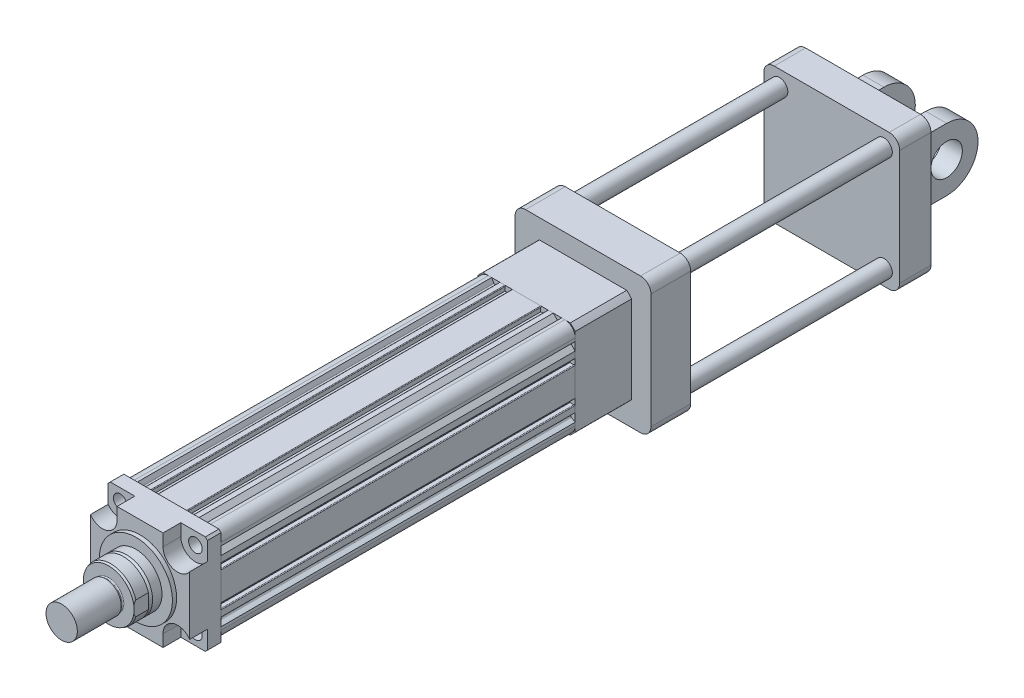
from build123d import *
from OCP.BRepFilletAPI import BRepFilletAPI_MakeChamfer

# Parameters (mm, degrees)
SKETCH_1_R          = 40
SKETCH_1_R_2        = 4.35
EXTRUDE_1_DEPTH     = 340
EXTRUDE_1_2_DEPTH   = 30
SKETCH_3_R          = 35
EXTRUDE_2_DEPTH     = 4
SKETCH_3_3_R        = 6.5
CUT_EXTRUDE_1_DEPTH = 30
SKETCH_3_4_R        = 6.5
CUT_EXTRUDE_2_DEPTH = 17
SKETCH_4_R          = 25
EXTRUDE_3_DEPTH     = 12
CHAMFER_1_SIZE      = 3
CHAMFER_1_SIZE2     = 1.732050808
EXTRUDE_4_DEPTH     = 14
CHAMFER_2_SIZE      = 2
CHAMFER_2_SIZE2     = 0.727940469
SKETCH_6_R          = 13.5
EXTRUDE_5_DEPTH     = 3
SKETCH_7_R          = 15
EXTRUDE_6_DEPTH     = 42
FILLET_1_R          = 1
EXTRUDE_7_DEPTH     = 54
SKETCH_9_W          = 130
SKETCH_9_H          = 130
EXTRUDE_8_DEPTH     = 38
SKETCH_10_R         = 40
CUT_EXTRUDE_3_DEPTH = 18.5
SKETCH_11_R         = 32
CUT_EXTRUDE_4_DEPTH = 15
SKETCH_12_R         = 40
EXTRUDE_9_DEPTH     = 1
EXTRUDE_START       = 200
SKETCH_13_W         = 130
SKETCH_13_H         = 130
EXTRUDE_10_DEPTH    = 30
SKETCH_14_R         = 8
EXTRUDE_11_DEPTH    = 200
SKETCH_15_W         = 20
SKETCH_15_H         = 60
EXTRUDE_12_DEPTH    = 70
SKETCH_16_R         = 15
CUT_EXTRUDE_5_DEPTH = 94
FILLET_2_R          = 10
FILLET_3_R          = 10
CHAMFER_3_SIZE      = 5


with BuildPart() as part:
    # Sketch 1 → Extrude 1 (new body)
    with BuildSketch(Plane.XY):
        with BuildLine():
            Line((46.5, -36.5), (46.5, -33.5))
            Line((46.5, -33.5), (42.782554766, -31.353731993))
            ThreePointArc((42.782554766, -31.353731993), (42.192820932, -30.47113294), (42.534026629, -29.465973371))
            Line((42.534026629, -29.465973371), (46.5, -25.5))
            Line((46.5, -25.5), (46.5, -19.6))
            ThreePointArc((46.5, -19.6), (46.353553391, -19.246446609), (46, -19.1))
            ThreePointArc((46, -19.1), (45.646446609, -19.246446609), (45.5, -19.6))
            Line((45.5, -19.6), (41.5, -19.6))
            Line((41.5, -19.6), (41.5, -13.5))
            Line((41.5, -13.5), (45.5, -13.5))
            ThreePointArc((45.5, -13.5), (45.646446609, -13.853553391), (46, -14))
            ThreePointArc((46, -14), (46.353553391, -13.853553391), (46.5, -13.5))
            Line((46.5, -13.5), (46.5, 13.5))
            ThreePointArc((46.5, 13.5), (46.353553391, 13.853553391), (46, 14))
            ThreePointArc((46, 14), (45.646446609, 13.853553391), (45.5, 13.5))
            Line((45.5, 13.5), (41.5, 13.5))
            Line((41.5, 13.5), (41.5, 19.6))
            Line((41.5, 19.6), (45.5, 19.6))
            ThreePointArc((45.5, 19.6), (45.646446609, 19.246446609), (46, 19.1))
            ThreePointArc((46, 19.1), (46.353553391, 19.246446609), (46.5, 19.6))
            Line((46.5, 19.6), (46.5, 25.5))
            Line((46.5, 25.5), (42.534026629, 29.465973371))
            ThreePointArc((42.534026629, 29.465973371), (42.192820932, 30.47113294), (42.782554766, 31.353731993))
            Line((42.782554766, 31.353731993), (46.5, 33.5))
            Line((46.5, 33.5), (46.5, 36.5))
            ThreePointArc((46.5, 36.5), (43.571067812, 43.571067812), (36.5, 46.5))
            Line((36.5, 46.5), (33.5, 46.5))
            Line((33.5, 46.5), (31.353731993, 42.782554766))
            ThreePointArc((31.353731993, 42.782554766), (30.47113294, 42.192820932), (29.465973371, 42.534026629))
            Line((29.465973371, 42.534026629), (25.5, 46.5))
            Line((25.5, 46.5), (20.8, 46.5))
            ThreePointArc((20.8, 46.5), (20.446446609, 46.353553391), (20.3, 46))
            ThreePointArc((20.3, 46), (20.446446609, 45.646446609), (20.8, 45.5))
            Line((20.8, 45.5), (20.8, 41.5))
            Line((20.8, 41.5), (13.5, 41.5))
            Line((13.5, 41.5), (13.5, 45.5))
            ThreePointArc((13.5, 45.5), (13.853553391, 45.646446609), (14, 46))
            ThreePointArc((14, 46), (13.853553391, 46.353553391), (13.5, 46.5))
            Line((13.5, 46.5), (-13.5, 46.5))
            ThreePointArc((-13.5, 46.5), (-13.853553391, 46.353553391), (-14, 46))
            ThreePointArc((-14, 46), (-13.853553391, 45.646446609), (-13.5, 45.5))
            Line((-13.5, 45.5), (-13.5, 41.5))
            Line((-13.5, 41.5), (-20.8, 41.5))
            Line((-20.8, 41.5), (-20.8, 45.5))
            ThreePointArc((-20.8, 45.5), (-20.446446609, 45.646446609), (-20.3, 46))
            ThreePointArc((-20.3, 46), (-20.446446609, 46.353553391), (-20.8, 46.5))
            Line((-20.8, 46.5), (-25.5, 46.5))
            Line((-25.5, 46.5), (-29.465973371, 42.534026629))
            ThreePointArc((-29.465973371, 42.534026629), (-30.47113294, 42.192820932), (-31.353731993, 42.782554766))
            Line((-31.353731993, 42.782554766), (-33.5, 46.5))
            Line((-33.5, 46.5), (-36.5, 46.5))
            ThreePointArc((-36.5, 46.5), (-43.571067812, 43.571067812), (-46.5, 36.5))
            Line((-46.5, 36.5), (-46.5, 33.5))
            Line((-46.5, 33.5), (-42.782554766, 31.353731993))
            ThreePointArc((-42.782554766, 31.353731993), (-42.192820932, 30.47113294), (-42.534026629, 29.465973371))
            Line((-42.534026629, 29.465973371), (-46.5, 25.5))
            Line((-46.5, 25.5), (-46.5, 20))
            ThreePointArc((-46.5, 20), (-46.353553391, 19.646446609), (-46, 19.5))
            ThreePointArc((-46, 19.5), (-45.646446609, 19.646446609), (-45.5, 20))
            Line((-45.5, 20), (-41.5, 20))
            Line((-41.5, 20), (-41.5, 13.9))
            Line((-41.5, 13.9), (-45.5, 13.9))
            ThreePointArc((-45.5, 13.9), (-45.646446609, 14.253553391), (-46, 14.4))
            ThreePointArc((-46, 14.4), (-46.353553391, 14.253553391), (-46.5, 13.9))
            Line((-46.5, 13.9), (-46.5, -13.9))
            ThreePointArc((-46.5, -13.9), (-46.353553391, -14.253553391), (-46, -14.4))
            ThreePointArc((-46, -14.4), (-45.646446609, -14.253553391), (-45.5, -13.9))
            Line((-45.5, -13.9), (-41.5, -13.9))
            Line((-41.5, -13.9), (-41.5, -20))
            Line((-41.5, -20), (-45.5, -20))
            ThreePointArc((-45.5, -20), (-45.646446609, -19.646446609), (-46, -19.5))
            ThreePointArc((-46, -19.5), (-46.353553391, -19.646446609), (-46.5, -20))
            Line((-46.5, -20), (-46.5, -25.5))
            Line((-46.5, -25.5), (-42.534026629, -29.465973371))
            ThreePointArc((-42.534026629, -29.465973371), (-42.192820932, -30.47113294), (-42.782554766, -31.353731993))
            Line((-42.782554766, -31.353731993), (-46.5, -33.5))
            Line((-46.5, -33.5), (-46.5, -36.5))
            ThreePointArc((-46.5, -36.5), (-43.571067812, -43.571067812), (-36.5, -46.5))
            Line((-36.5, -46.5), (-33.5, -46.5))
            Line((-33.5, -46.5), (-31.353731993, -42.782554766))
            ThreePointArc((-31.353731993, -42.782554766), (-30.47113294, -42.192820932), (-29.465973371, -42.534026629))
            Line((-29.465973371, -42.534026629), (-25.5, -46.5))
            Line((-25.5, -46.5), (25.5, -46.5))
            Line((25.5, -46.5), (29.465973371, -42.534026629))
            ThreePointArc((29.465973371, -42.534026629), (30.47113294, -42.192820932), (31.353731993, -42.782554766))
            Line((31.353731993, -42.782554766), (33.5, -46.5))
            Line((33.5, -46.5), (36.5, -46.5))
            ThreePointArc((36.5, -46.5), (43.571067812, -43.571067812), (46.5, -36.5))
        make_face()
        Circle(SKETCH_1_R, mode=Mode.SUBTRACT)
        with Locations((36, -36)):
            Circle(SKETCH_1_R_2, mode=Mode.SUBTRACT)
        with Locations((-36, -36)):
            Circle(SKETCH_1_R_2, mode=Mode.SUBTRACT)
        with Locations((36, 36)):
            Circle(SKETCH_1_R_2, mode=Mode.SUBTRACT)
        with Locations((-36, 36)):
            Circle(SKETCH_1_R_2, mode=Mode.SUBTRACT)
        with BuildLine():
            Line((25.75, -42.5), (11.324751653, -42.5))
            ThreePointArc((11.324751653, -42.5), (10.829080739, -42.065653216), (11.194582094, -41.517241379))
            ThreePointArc((11.194582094, -41.517241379), (18.919894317, -38.613956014), (25.948275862, -34.288292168))
            ThreePointArc((25.948275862, -34.288292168), (26.472640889, -34.239297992), (26.75, -34.68699324))
            Line((26.75, -34.68699324), (26.75, -41.5))
            Line((26.75, -41.5), (25.75, -42.5))
        make_face(mode=Mode.SUBTRACT)
        with BuildLine():
            Line((-25.75, -42.5), (-11.324751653, -42.5))
            ThreePointArc((-11.324751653, -42.5), (-10.829080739, -42.065653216), (-11.194582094, -41.517241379))
            ThreePointArc((-11.194582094, -41.517241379), (-18.919894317, -38.613956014), (-25.948275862, -34.288292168))
            ThreePointArc((-25.948275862, -34.288292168), (-26.472640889, -34.239297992), (-26.75, -34.68699324))
            Line((-26.75, -34.68699324), (-26.75, -41.5))
            Line((-26.75, -41.5), (-25.75, -42.5))
        make_face(mode=Mode.SUBTRACT)
        with BuildLine():
            Line((26.312283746, 40), (20.798294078, 40))
            ThreePointArc((20.798294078, 40), (20.548294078, 39.933012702), (20.365281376, 39.75))
            Line((20.365281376, 39.75), (19.794336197, 38.761093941))
            ThreePointArc((19.794336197, 38.761093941), (19.747068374, 38.372059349), (19.994850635, 38.068437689))
            ThreePointArc((19.994850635, 38.068437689), (22.57372353, 36.598183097), (25.045011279, 34.953503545))
            ThreePointArc((25.045011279, 34.953503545), (25.441798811, 34.871210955), (25.769245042, 35.109939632))
            Line((25.769245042, 35.109939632), (27.64187192, 38.353424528))
            ThreePointArc((27.64187192, 38.353424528), (27.704581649, 38.668687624), (27.562412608, 38.956977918))
            Line((27.562412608, 38.956977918), (26.665837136, 39.853553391))
            ThreePointArc((26.665837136, 39.853553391), (26.503625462, 39.961939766), (26.312283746, 40))
        make_face(mode=Mode.SUBTRACT)
        with BuildLine():
            Line((38.956977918, 27.562412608), (39.853553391, 26.665837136))
            ThreePointArc((39.853553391, 26.665837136), (39.961939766, 26.503625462), (40, 26.312283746))
            Line((40, 26.312283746), (40, 20.798294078))
            ThreePointArc((40, 20.798294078), (39.933012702, 20.548294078), (39.75, 20.365281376))
            Line((39.75, 20.365281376), (38.761093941, 19.794336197))
            ThreePointArc((38.761093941, 19.794336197), (38.372059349, 19.747068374), (38.068437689, 19.994850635))
            ThreePointArc((38.068437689, 19.994850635), (36.598183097, 22.57372353), (34.953503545, 25.045011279))
            ThreePointArc((34.953503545, 25.045011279), (34.871210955, 25.441798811), (35.109939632, 25.769245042))
            Line((35.109939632, 25.769245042), (38.353424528, 27.64187192))
            ThreePointArc((38.353424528, 27.64187192), (38.668687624, 27.704581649), (38.956977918, 27.562412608))
        make_face(mode=Mode.SUBTRACT)
        with BuildLine():
            Line((38.956977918, -27.562412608), (39.853553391, -26.665837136))
            ThreePointArc((39.853553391, -26.665837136), (39.961939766, -26.503625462), (40, -26.312283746))
            Line((40, -26.312283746), (40, -20.798294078))
            ThreePointArc((40, -20.798294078), (39.933012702, -20.548294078), (39.75, -20.365281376))
            Line((39.75, -20.365281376), (38.761093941, -19.794336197))
            ThreePointArc((38.761093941, -19.794336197), (38.372059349, -19.747068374), (38.068437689, -19.994850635))
            ThreePointArc((38.068437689, -19.994850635), (36.598183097, -22.57372353), (34.953503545, -25.045011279))
            ThreePointArc((34.953503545, -25.045011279), (34.871210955, -25.441798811), (35.109939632, -25.769245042))
            Line((35.109939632, -25.769245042), (38.353424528, -27.64187192))
            ThreePointArc((38.353424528, -27.64187192), (38.668687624, -27.704581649), (38.956977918, -27.562412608))
        make_face(mode=Mode.SUBTRACT)
        with BuildLine():
            Line((-39.75, -20.365281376), (-38.761093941, -19.794336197))
            ThreePointArc((-38.761093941, -19.794336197), (-38.372059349, -19.747068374), (-38.068437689, -19.994850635))
            ThreePointArc((-38.068437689, -19.994850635), (-36.598183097, -22.57372353), (-34.953503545, -25.045011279))
            ThreePointArc((-34.953503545, -25.045011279), (-34.871210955, -25.441798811), (-35.109939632, -25.769245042))
            Line((-35.109939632, -25.769245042), (-38.353424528, -27.64187192))
            ThreePointArc((-38.353424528, -27.64187192), (-38.668687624, -27.704581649), (-38.956977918, -27.562412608))
            Line((-38.956977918, -27.562412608), (-39.853553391, -26.665837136))
            ThreePointArc((-39.853553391, -26.665837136), (-39.961939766, -26.503625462), (-40, -26.312283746))
            Line((-40, -26.312283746), (-40, -20.798294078))
            ThreePointArc((-40, -20.798294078), (-39.933012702, -20.548294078), (-39.75, -20.365281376))
        make_face(mode=Mode.SUBTRACT)
        with BuildLine():
            Line((-20.365281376, 39.75), (-19.794336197, 38.761093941))
            ThreePointArc((-19.794336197, 38.761093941), (-19.747068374, 38.372059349), (-19.994850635, 38.068437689))
            ThreePointArc((-19.994850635, 38.068437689), (-22.57372353, 36.598183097), (-25.045011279, 34.953503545))
            ThreePointArc((-25.045011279, 34.953503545), (-25.441798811, 34.871210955), (-25.769245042, 35.109939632))
            Line((-25.769245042, 35.109939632), (-27.64187192, 38.353424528))
            ThreePointArc((-27.64187192, 38.353424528), (-27.704581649, 38.668687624), (-27.562412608, 38.956977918))
            Line((-27.562412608, 38.956977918), (-26.665837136, 39.853553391))
            ThreePointArc((-26.665837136, 39.853553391), (-26.503625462, 39.961939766), (-26.312283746, 40))
            Line((-26.312283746, 40), (-20.798294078, 40))
            ThreePointArc((-20.798294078, 40), (-20.548294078, 39.933012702), (-20.365281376, 39.75))
        make_face(mode=Mode.SUBTRACT)
        with BuildLine():
            Line((-38.956977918, 27.562412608), (-39.853553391, 26.665837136))
            ThreePointArc((-39.853553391, 26.665837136), (-39.961939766, 26.503625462), (-40, 26.312283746))
            Line((-40, 26.312283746), (-40, 20.798294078))
            ThreePointArc((-40, 20.798294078), (-39.933012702, 20.548294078), (-39.75, 20.365281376))
            Line((-39.75, 20.365281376), (-38.761093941, 19.794336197))
            ThreePointArc((-38.761093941, 19.794336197), (-38.372059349, 19.747068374), (-38.068437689, 19.994850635))
            ThreePointArc((-38.068437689, 19.994850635), (-36.598183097, 22.57372353), (-34.953503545, 25.045011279))
            ThreePointArc((-34.953503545, 25.045011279), (-34.871210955, 25.441798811), (-35.109939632, 25.769245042))
            Line((-35.109939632, 25.769245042), (-38.353424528, 27.64187192))
            ThreePointArc((-38.353424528, 27.64187192), (-38.668687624, 27.704581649), (-38.956977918, 27.562412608))
        make_face(mode=Mode.SUBTRACT)
    extrude(amount=EXTRUDE_1_DEPTH)

    # Sketch 2 → Extrude 1 2 (add)
    with BuildSketch(Plane.XY.offset(340)):
        Polygon((-47.5, 45.5), (-45.5, 47.5), (45.5, 47.5), (47.5, 45.5), (47.5, -45.5), (45.5, -47.5), (-45.5, -47.5), (-47.5, -45.5), align=None)
    extrude(amount=EXTRUDE_1_2_DEPTH)

    # Sketch 3 → Extrude 2 (add)
    with BuildSketch(Plane.XY.offset(370)):
        Circle(SKETCH_3_R)
    extrude(amount=EXTRUDE_2_DEPTH)

    # Sketch 3_3 → Cut-Extrude 1 (cut)
    with BuildSketch(Plane.XY.offset(370)):
        with Locations((-36, 36)):
            Circle(SKETCH_3_3_R)
        with Locations((36, 36)):
            Circle(SKETCH_3_3_R)
        with Locations((60, 32.5)):
            Circle(SKETCH_3_3_R)
        with Locations((36, -36)):
            Circle(SKETCH_3_3_R)
        with Locations((-36, -36)):
            Circle(SKETCH_3_3_R)
        with Locations((-60, -32.5)):
            Circle(SKETCH_3_3_R)
        with Locations((-60, 32.5)):
            Circle(SKETCH_3_3_R)
    extrude(amount=-CUT_EXTRUDE_1_DEPTH, mode=Mode.SUBTRACT)

    # Sketch 3_4 → Cut-Extrude 2 (cut)
    # profile 1 of 4: a face of its own
    with BuildSketch(Plane.XY.offset(370)):
        with BuildLine():
            Line((-47.5, 45.5), (-47.5, 28.015640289))
            ThreePointArc((-47.5, 28.015640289), (-31.816699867, 22.639610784), (-22, 36))
            Line((-22, 36), (-22, 47.5))
            Line((-22, 47.5), (-45.5, 47.5))
            Line((-45.5, 47.5), (-47.5, 45.5))
        make_face()
        with Locations((-36, 36)):
            Circle(SKETCH_3_4_R, mode=Mode.SUBTRACT)
    # profile 2 of 4: a face of its own
    with BuildSketch(Plane.XY.offset(370)):
        with BuildLine():
            ThreePointArc((-22, -36), (-31.816699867, -22.639610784), (-47.5, -28.015640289))
            Line((-47.5, -28.015640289), (-47.5, -45.5))
            Line((-47.5, -45.5), (-45.5, -47.5))
            Line((-45.5, -47.5), (-22, -47.5))
            Line((-22, -47.5), (-22, -36))
        make_face()
        with Locations((-36, -36)):
            Circle(SKETCH_3_4_R, mode=Mode.SUBTRACT)
    # profile 3 of 4: a face of its own
    with BuildSketch(Plane.XY.offset(370)):
        with BuildLine():
            Line((45.5, 47.5), (22, 47.5))
            Line((22, 47.5), (22, 36))
            ThreePointArc((22, 36), (31.816699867, 22.639610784), (47.5, 28.015640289))
            Line((47.5, 28.015640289), (47.5, 45.5))
            Line((47.5, 45.5), (45.5, 47.5))
        make_face()
        with Locations((36, 36)):
            Circle(SKETCH_3_4_R, mode=Mode.SUBTRACT)
    # profile 4 of 4: a face of its own
    with BuildSketch(Plane.XY.offset(370)):
        with BuildLine():
            Line((22, -36), (22, -47.5))
            Line((22, -47.5), (45.5, -47.5))
            Line((45.5, -47.5), (47.5, -45.5))
            Line((47.5, -45.5), (47.5, -28.015640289))
            ThreePointArc((47.5, -28.015640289), (31.816699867, -22.639610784), (22, -36))
        make_face()
        with Locations((36, -36)):
            Circle(SKETCH_3_4_R, mode=Mode.SUBTRACT)
    extrude(amount=-CUT_EXTRUDE_2_DEPTH, mode=Mode.SUBTRACT)

    # Sketch 4 → Extrude 3 (add)
    with BuildSketch(Plane.XY.offset(374)):
        Circle(SKETCH_4_R)
    extrude(amount=EXTRUDE_3_DEPTH)

    # Chamfer 1
    chamfer_1_edges = [part.edges().sort_by_distance(p)[0] for p in [
        (-25, 0, 386),
    ]]
    chamfer_1_side = [part.faces().sort_by_distance(p)[0] for p in [
        (-25, 0, 380),
    ]]
    chamfer(chamfer_1_edges, length=CHAMFER_1_SIZE, length2=CHAMFER_1_SIZE2, reference=chamfer_1_side[0])

    # Sketch 5 → Extrude 4 (add)
    with BuildSketch(Plane.XY.offset(386)):
        with BuildLine():
            Line((-24, 7), (-24, -7))
            ThreePointArc((-24, -7), (0, -25), (24, -7))
            Line((24, -7), (24, 7))
            ThreePointArc((24, 7), (0, 25), (-24, 7))
        make_face()
    extrude(amount=EXTRUDE_4_DEPTH)

    # Chamfer 2: one chamfer whose edges measure the first distance from different faces: ONE call of the kernel's chamfer builder (chamfer() names one face for all edges)
    chamfer_2_edges_1 = [part.edges().sort_by_distance(p)[0] for p in [
        (0, 25, 400),
    ]]
    chamfer_2_side_1 = [part.faces().sort_by_distance(p)[0] for p in [
        (0, 25, 393),
    ]]
    chamfer_2_edges_2 = [part.edges().sort_by_distance(p)[0] for p in [
        (0, -25, 400),
    ]]
    chamfer_2_side_2 = [part.faces().sort_by_distance(p)[0] for p in [
        (0, -25, 393),
    ]]
    chamfer_2 = BRepFilletAPI_MakeChamfer(part.part.solid().wrapped)
    for e in chamfer_2_edges_1:
        chamfer_2.Add(CHAMFER_2_SIZE, CHAMFER_2_SIZE2, e.wrapped, chamfer_2_side_1[0].wrapped)  # the first distance lies on this face
    for e in chamfer_2_edges_2:
        chamfer_2.Add(CHAMFER_2_SIZE, CHAMFER_2_SIZE2, e.wrapped, chamfer_2_side_2[0].wrapped)  # the first distance lies on this face
    add(Compound.cast(chamfer_2.Shape()), mode=Mode.REPLACE)

    # Sketch 6 → Extrude 5 (add)
    with BuildSketch(Plane.XY.offset(400)):
        Circle(SKETCH_6_R)
    extrude(amount=EXTRUDE_5_DEPTH)

    # Sketch 7 → Extrude 6 (add)
    with BuildSketch(Plane.XY.offset(403)):
        with Locations(Location((0, 0, 0), (0, 0, 180))):
            Circle(SKETCH_7_R)
    extrude(amount=EXTRUDE_6_DEPTH)

    # Fillet 1
    fillet_1_edges = [part.edges().sort_by_distance(p)[0] for p in [
        (-13.5, 0, 400),
    ]]
    fillet(fillet_1_edges, radius=FILLET_1_R)


with BuildPart() as body_2:
    # Sketch 8 → Extrude 7 (new body)
    with BuildSketch(Plane(origin=(0, 0, 0), x_dir=(-1, 0, 0), z_dir=(0, 0, -1))):
        with BuildLine():
            Line((-41.761226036, 46.5), (41.761226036, 46.5))
            ThreePointArc((41.761226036, 46.5), (44.194173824, 44.194173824), (46.5, 41.761226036))
            Line((46.5, 41.761226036), (46.5, -41.761226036))
            ThreePointArc((46.5, -41.761226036), (44.194173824, -44.194173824), (41.761226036, -46.5))
            Line((41.761226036, -46.5), (-41.761226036, -46.5))
            ThreePointArc((-41.761226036, -46.5), (-44.194173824, -44.194173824), (-46.5, -41.761226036))
            Line((-46.5, -41.761226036), (-46.5, 41.761226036))
            ThreePointArc((-46.5, 41.761226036), (-44.194173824, 44.194173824), (-41.761226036, 46.5))
        make_face()
    extrude(amount=EXTRUDE_7_DEPTH)

    # Sketch 9 → Extrude 8 (add)
    with BuildSketch(Plane(origin=(0, 0, -54), x_dir=(-1, 0, 0), z_dir=(0, 0, -1))):
        Rectangle(SKETCH_9_W, SKETCH_9_H)
    extrude(amount=EXTRUDE_8_DEPTH)

    # Sketch 10 → Cut-Extrude 3 (cut)
    with BuildSketch(Plane(origin=(0, 0, -92), x_dir=(-1, 0, 0), z_dir=(0, 0, -1))):
        Circle(SKETCH_10_R)
    extrude(amount=-CUT_EXTRUDE_3_DEPTH, mode=Mode.SUBTRACT)

    # Sketch 11 → Cut-Extrude 4 (cut)
    with BuildSketch(Plane(origin=(0, 0, -73.5), x_dir=(-1, 0, 0), z_dir=(0, 0, -1))):
        Circle(SKETCH_11_R)
    extrude(amount=-CUT_EXTRUDE_4_DEPTH, mode=Mode.SUBTRACT)

    # Sketch 12 → Extrude 9 (add)
    with BuildSketch(Plane(origin=(0, 0, -92), x_dir=(-1, 0, 0), z_dir=(0, 0, -1))):
        Circle(SKETCH_12_R)
    extrude(amount=-EXTRUDE_9_DEPTH)

    # Sketch 14 → Extrude 11 (add)
    with BuildSketch(Plane(origin=(0, 0, -92), x_dir=(-1, 0, 0), z_dir=(0, 0, -1))):
        with Locations((50, 50)):
            Circle(SKETCH_14_R)
        with Locations((50, -50)):
            Circle(SKETCH_14_R)
        with Locations(Location((-50, -50, 0), (0, 0, 180))):
            Circle(SKETCH_14_R)
        with Locations(Location((-50, 50, 0), (0, 0, 180))):
            Circle(SKETCH_14_R)
    extrude(amount=EXTRUDE_11_DEPTH)

    # Fillet 3
    fillet_3_edges = [body_2.edges().sort_by_distance(p)[0] for p in [
        (-65, -65, -73),
        (-65, 65, -73),
        (65, 65, -73),
        (65, -65, -73),
    ]]
    fillet(fillet_3_edges, radius=FILLET_3_R)


with BuildPart() as body_3:
    # Sketch 13 → Extrude 10 (new body)
    with BuildSketch(Plane(origin=(0, 0, -92), x_dir=(-1, 0, 0), z_dir=(0, 0, -1)).offset(EXTRUDE_START)):
        Rectangle(SKETCH_13_W, SKETCH_13_H)
    extrude(amount=EXTRUDE_10_DEPTH)

    # Sketch 15 → Extrude 12 (add)
    with BuildSketch(Plane(origin=(0, 0, -322), x_dir=(-1, 0, 0), z_dir=(0, 0, -1))):
        with Locations((30, 0)):
            Rectangle(SKETCH_15_W, SKETCH_15_H)
        with Locations((-30, 0)):
            Rectangle(SKETCH_15_W, SKETCH_15_H)
    extrude(amount=EXTRUDE_12_DEPTH)

    # Sketch 16 → Cut-Extrude 5 (cut)
    with BuildSketch(Plane.ZY.offset(40)):
        with Locations(Location((-362, 0, 0), (0, 0, 270))):
            Circle(SKETCH_16_R)
        with BuildLine():
            Line((-362, 30), (-405.219394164, 42.518656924))
            Line((-405.219394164, 42.518656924), (-392.904001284, -55.167669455))
            Line((-392.904001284, -55.167669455), (-362, -30))
            ThreePointArc((-362, -30), (-392, 0), (-362, 30))
        make_face()
    extrude(amount=-CUT_EXTRUDE_5_DEPTH, mode=Mode.SUBTRACT)

    # Fillet 2
    fillet_2_edges = [body_3.edges().sort_by_distance(p)[0] for p in [
        (65, 65, -307),
        (-65, 65, -307),
        (-65, -65, -307),
        (65, -65, -307),
    ]]
    fillet(fillet_2_edges, radius=FILLET_2_R)

    # Chamfer 3
    chamfer_3_edges = [body_3.edges().sort_by_distance(p)[0] for p in [
        (-20, 0, -322),
        (-30, -30, -322),
        (-40, 0, -322),
        (-30, 30, -322),
        (40, 0, -322),
        (30, -30, -322),
        (30, 30, -322),
        (20, 0, -322),
    ]]
    chamfer(chamfer_3_edges, length=CHAMFER_3_SIZE)


solid = Compound([part.part, body_2.part, body_3.part])
